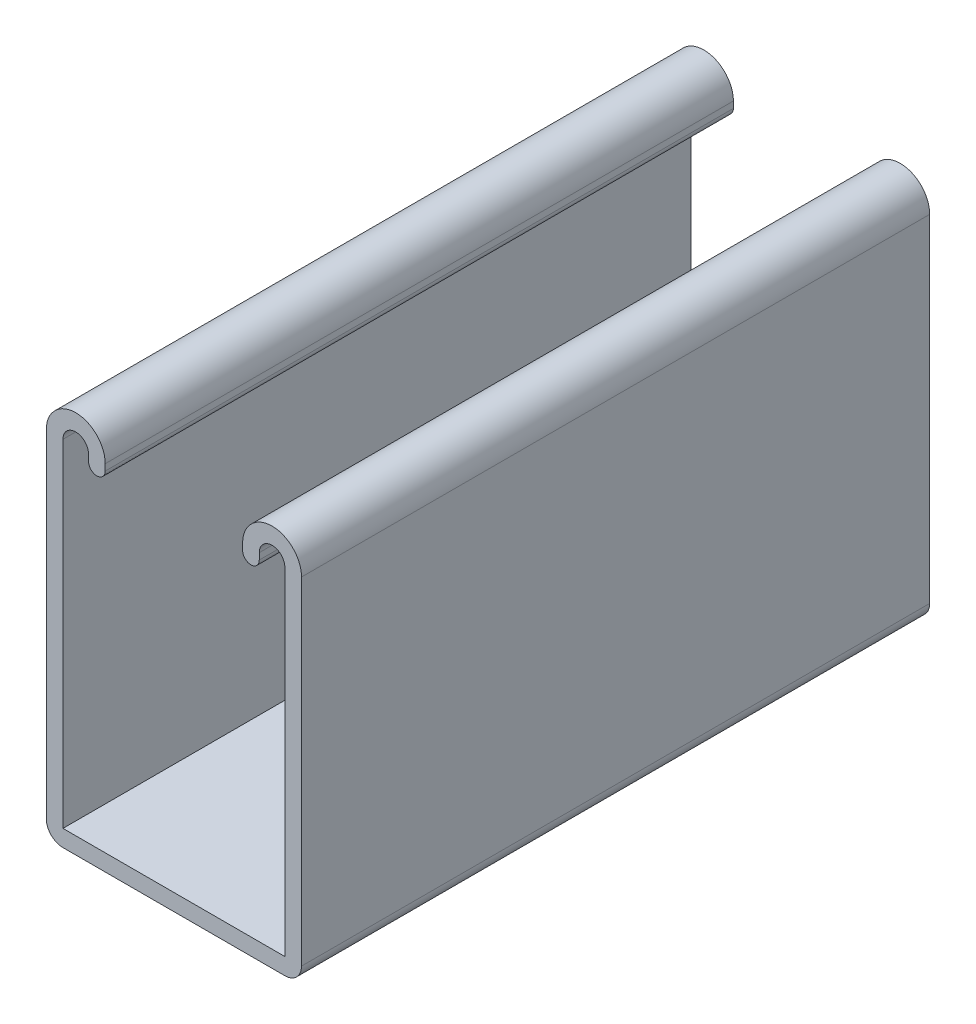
ISO-10303-21;
HEADER;
FILE_DESCRIPTION(('STEP AP214'),'2;1');
FILE_NAME('part.step','',(''),(''),'','','');
FILE_SCHEMA(('AUTOMOTIVE_DESIGN { 1 0 10303 214 1 1 1 1 }'));
ENDSEC;
DATA;
#1=APPLICATION_CONTEXT('core data for automotive mechanical design processes');
#2=APPLICATION_PROTOCOL_DEFINITION('international standard','automotive_design',2000,#1);
#3=PRODUCT_CONTEXT('',#1,'mechanical');
#4=PRODUCT('Part','Part','',(#3));
#5=PRODUCT_RELATED_PRODUCT_CATEGORY('part','',(#4));
#6=PRODUCT_DEFINITION_FORMATION('','',#4);
#7=PRODUCT_DEFINITION_CONTEXT('part definition',#1,'design');
#8=PRODUCT_DEFINITION('design','',#6,#7);
#9=PRODUCT_DEFINITION_SHAPE('','',#8);
#10=(LENGTH_UNIT() NAMED_UNIT(*) SI_UNIT(.MILLI.,.METRE.));
#11=(NAMED_UNIT(*) PLANE_ANGLE_UNIT() SI_UNIT($,.RADIAN.));
#12=(NAMED_UNIT(*) SI_UNIT($,.STERADIAN.) SOLID_ANGLE_UNIT());
#13=UNCERTAINTY_MEASURE_WITH_UNIT(LENGTH_MEASURE(1.E-05),#10,'distance_accuracy_value','');
#14=(GEOMETRIC_REPRESENTATION_CONTEXT(3) GLOBAL_UNCERTAINTY_ASSIGNED_CONTEXT((#13)) GLOBAL_UNIT_ASSIGNED_CONTEXT((#10,
#11,#12)) REPRESENTATION_CONTEXT('',''));
#15=CARTESIAN_POINT('',(0.,0.,0.));
#16=DIRECTION('',(0.,0.,1.));
#17=DIRECTION('',(1.,0.,0.));
#18=AXIS2_PLACEMENT_3D('',#15,#16,#17);
#19=CARTESIAN_POINT('',(-15.875,29.1719,101.6));
#20=DIRECTION('',(0.,0.,-1.));
#21=DIRECTION('',(-1.,0.,0.));
#22=AXIS2_PLACEMENT_3D('',#19,#20,#21);
#23=CYLINDRICAL_SURFACE('',#22,4.7625);
#24=CARTESIAN_POINT('',(-15.875,29.1719,0.));
#25=DIRECTION('',(0.,0.,1.));
#26=DIRECTION('',(-1.,0.,0.));
#27=AXIS2_PLACEMENT_3D('',#24,#25,#26);
#28=CIRCLE('',#27,4.7625);
#29=CARTESIAN_POINT('',(-11.1125,29.1719,0.));
#30=VERTEX_POINT('',#29);
#31=CARTESIAN_POINT('',(-20.6375,29.1719,0.));
#32=VERTEX_POINT('',#31);
#33=EDGE_CURVE('E196',#30,#32,#28,.T.);
#34=ORIENTED_EDGE('',*,*,#33,.T.);
#35=DIRECTION('',(0.,0.,-1.));
#36=VECTOR('',#35,1.);
#37=CARTESIAN_POINT('',(-20.6375,29.1719,101.6));
#38=LINE('',#37,#36);
#39=CARTESIAN_POINT('',(-20.6375,29.1719,101.6));
#40=VERTEX_POINT('',#39);
#41=EDGE_CURVE('E11',#40,#32,#38,.T.);
#42=ORIENTED_EDGE('',*,*,#41,.F.);
#43=CARTESIAN_POINT('',(-15.875,29.1719,101.6));
#44=DIRECTION('',(0.,0.,1.));
#45=DIRECTION('',(-1.,0.,0.));
#46=AXIS2_PLACEMENT_3D('',#43,#44,#45);
#47=CIRCLE('',#46,4.7625);
#48=CARTESIAN_POINT('',(-11.1125,29.1719,101.6));
#49=VERTEX_POINT('',#48);
#50=EDGE_CURVE('E230',#49,#40,#47,.T.);
#51=ORIENTED_EDGE('',*,*,#50,.F.);
#52=DIRECTION('',(0.,0.,-1.));
#53=VECTOR('',#52,1.);
#54=CARTESIAN_POINT('',(-11.1125,29.1719,101.6));
#55=LINE('',#54,#53);
#56=EDGE_CURVE('E192',#49,#30,#55,.T.);
#57=ORIENTED_EDGE('',*,*,#56,.T.);
#58=EDGE_LOOP('',(#34,#42,#51,#57));
#59=FACE_BOUND('',#58,.T.);
#60=ADVANCED_FACE('F39',(#59),#23,.T.);
#61=CARTESIAN_POINT('',(-20.6375,29.1719,101.6));
#62=DIRECTION('',(1.,0.,0.));
#63=DIRECTION('',(0.,1.,0.));
#64=AXIS2_PLACEMENT_3D('',#61,#62,#63);
#65=PLANE('',#64);
#66=DIRECTION('',(0.,-1.,0.));
#67=VECTOR('',#66,1.);
#68=CARTESIAN_POINT('',(-20.6375,29.1719,0.));
#69=LINE('',#68,#67);
#70=CARTESIAN_POINT('',(-20.6375,-25.3238,0.));
#71=VERTEX_POINT('',#70);
#72=EDGE_CURVE('E199',#32,#71,#69,.T.);
#73=ORIENTED_EDGE('',*,*,#72,.T.);
#74=DIRECTION('',(0.,0.,-1.));
#75=VECTOR('',#74,1.);
#76=CARTESIAN_POINT('',(-20.6375,-25.3238,101.6));
#77=LINE('',#76,#75);
#78=CARTESIAN_POINT('',(-20.6375,-25.3238,101.6));
#79=VERTEX_POINT('',#78);
#80=EDGE_CURVE('E48',#79,#71,#77,.T.);
#81=ORIENTED_EDGE('',*,*,#80,.F.);
#82=DIRECTION('',(0.,-1.,0.));
#83=VECTOR('',#82,1.);
#84=CARTESIAN_POINT('',(-20.6375,29.1719,101.6));
#85=LINE('',#84,#83);
#86=EDGE_CURVE('E129',#40,#79,#85,.T.);
#87=ORIENTED_EDGE('',*,*,#86,.F.);
#88=ORIENTED_EDGE('',*,*,#41,.T.);
#89=EDGE_LOOP('',(#73,#81,#87,#88));
#90=FACE_BOUND('',#89,.T.);
#91=ADVANCED_FACE('F339',(#90),#65,.F.);
#92=CARTESIAN_POINT('',(-17.9451,-25.3238,101.6));
#93=DIRECTION('',(0.,0.,-1.));
#94=DIRECTION('',(-1.,0.,0.));
#95=AXIS2_PLACEMENT_3D('',#92,#93,#94);
#96=CYLINDRICAL_SURFACE('',#95,2.6924);
#97=CARTESIAN_POINT('',(-17.9451,-25.3238,0.));
#98=DIRECTION('',(0.,0.,1.));
#99=DIRECTION('',(-1.,0.,0.));
#100=AXIS2_PLACEMENT_3D('',#97,#98,#99);
#101=CIRCLE('',#100,2.6924);
#102=CARTESIAN_POINT('',(-17.9451,-28.0162,0.));
#103=VERTEX_POINT('',#102);
#104=EDGE_CURVE('E201',#71,#103,#101,.T.);
#105=ORIENTED_EDGE('',*,*,#104,.T.);
#106=DIRECTION('',(0.,0.,-1.));
#107=VECTOR('',#106,1.);
#108=CARTESIAN_POINT('',(-17.9451,-28.0162,101.6));
#109=LINE('',#108,#107);
#110=CARTESIAN_POINT('',(-17.9451,-28.0162,101.6));
#111=VERTEX_POINT('',#110);
#112=EDGE_CURVE('E267',#111,#103,#109,.T.);
#113=ORIENTED_EDGE('',*,*,#112,.F.);
#114=CARTESIAN_POINT('',(-17.9451,-25.3238,101.6));
#115=DIRECTION('',(0.,0.,1.));
#116=DIRECTION('',(-1.,0.,0.));
#117=AXIS2_PLACEMENT_3D('',#114,#115,#116);
#118=CIRCLE('',#117,2.6924);
#119=EDGE_CURVE('E276',#79,#111,#118,.T.);
#120=ORIENTED_EDGE('',*,*,#119,.F.);
#121=ORIENTED_EDGE('',*,*,#80,.T.);
#122=EDGE_LOOP('',(#105,#113,#120,#121));
#123=FACE_BOUND('',#122,.T.);
#124=ADVANCED_FACE('F274',(#123),#96,.T.);
#125=CARTESIAN_POINT('',(-17.9451,-28.0162,101.6));
#126=DIRECTION('',(0.,1.,0.));
#127=DIRECTION('',(-1.,0.,0.));
#128=AXIS2_PLACEMENT_3D('',#125,#126,#127);
#129=PLANE('',#128);
#130=CARTESIAN_POINT('',(0.,-28.0162,71.4375));
#131=DIRECTION('',(0.,-1.,0.));
#132=DIRECTION('',(1.,0.,0.));
#133=AXIS2_PLACEMENT_3D('',#130,#131,#132);
#134=CIRCLE('',#133,7.14375);
#135=CARTESIAN_POINT('',(7.14375,-28.0162,71.4375));
#136=VERTEX_POINT('',#135);
#137=EDGE_CURVE('E528',#136,#136,#134,.T.);
#138=ORIENTED_EDGE('',*,*,#137,.F.);
#139=EDGE_LOOP('',(#138));
#140=FACE_BOUND('',#139,.T.);
#141=CARTESIAN_POINT('',(0.,-28.0162,23.8125));
#142=DIRECTION('',(0.,-1.,0.));
#143=DIRECTION('',(1.,0.,0.));
#144=AXIS2_PLACEMENT_3D('',#141,#142,#143);
#145=CIRCLE('',#144,7.14375);
#146=CARTESIAN_POINT('',(7.14375,-28.0162,23.8125));
#147=VERTEX_POINT('',#146);
#148=EDGE_CURVE('E532',#147,#147,#145,.T.);
#149=ORIENTED_EDGE('',*,*,#148,.F.);
#150=EDGE_LOOP('',(#149));
#151=FACE_BOUND('',#150,.T.);
#152=DIRECTION('',(1.,0.,0.));
#153=VECTOR('',#152,1.);
#154=CARTESIAN_POINT('',(-17.9451,-28.0162,0.));
#155=LINE('',#154,#153);
#156=CARTESIAN_POINT('',(17.9451,-28.0162,0.));
#157=VERTEX_POINT('',#156);
#158=EDGE_CURVE('E203',#103,#157,#155,.T.);
#159=ORIENTED_EDGE('',*,*,#158,.T.);
#160=DIRECTION('',(0.,0.,-1.));
#161=VECTOR('',#160,1.);
#162=CARTESIAN_POINT('',(17.9451,-28.0162,101.6));
#163=LINE('',#162,#161);
#164=CARTESIAN_POINT('',(17.9451,-28.0162,101.6));
#165=VERTEX_POINT('',#164);
#166=EDGE_CURVE('E264',#165,#157,#163,.T.);
#167=ORIENTED_EDGE('',*,*,#166,.F.);
#168=DIRECTION('',(1.,0.,0.));
#169=VECTOR('',#168,1.);
#170=CARTESIAN_POINT('',(-17.9451,-28.0162,101.6));
#171=LINE('',#170,#169);
#172=EDGE_CURVE('E294',#111,#165,#171,.T.);
#173=ORIENTED_EDGE('',*,*,#172,.F.);
#174=ORIENTED_EDGE('',*,*,#112,.T.);
#175=EDGE_LOOP('',(#159,#167,#173,#174));
#176=FACE_BOUND('',#175,.T.);
#177=ADVANCED_FACE('F285',(#140,#151,#176),#129,.F.);
#178=CARTESIAN_POINT('',(17.9451,-25.3238,101.6));
#179=DIRECTION('',(0.,0.,-1.));
#180=DIRECTION('',(-1.,0.,0.));
#181=AXIS2_PLACEMENT_3D('',#178,#179,#180);
#182=CYLINDRICAL_SURFACE('',#181,2.6924);
#183=CARTESIAN_POINT('',(17.9451,-25.3238,0.));
#184=DIRECTION('',(0.,0.,1.));
#185=DIRECTION('',(1.,0.,0.));
#186=AXIS2_PLACEMENT_3D('',#183,#184,#185);
#187=CIRCLE('',#186,2.6924);
#188=CARTESIAN_POINT('',(20.6375,-25.3238,0.));
#189=VERTEX_POINT('',#188);
#190=EDGE_CURVE('E205',#157,#189,#187,.T.);
#191=ORIENTED_EDGE('',*,*,#190,.T.);
#192=DIRECTION('',(0.,0.,-1.));
#193=VECTOR('',#192,1.);
#194=CARTESIAN_POINT('',(20.6375,-25.3238,101.6));
#195=LINE('',#194,#193);
#196=CARTESIAN_POINT('',(20.6375,-25.3238,101.6));
#197=VERTEX_POINT('',#196);
#198=EDGE_CURVE('E261',#197,#189,#195,.T.);
#199=ORIENTED_EDGE('',*,*,#198,.F.);
#200=CARTESIAN_POINT('',(17.9451,-25.3238,101.6));
#201=DIRECTION('',(0.,0.,1.));
#202=DIRECTION('',(1.,0.,0.));
#203=AXIS2_PLACEMENT_3D('',#200,#201,#202);
#204=CIRCLE('',#203,2.6924);
#205=EDGE_CURVE('E291',#165,#197,#204,.T.);
#206=ORIENTED_EDGE('',*,*,#205,.F.);
#207=ORIENTED_EDGE('',*,*,#166,.T.);
#208=EDGE_LOOP('',(#191,#199,#206,#207));
#209=FACE_BOUND('',#208,.T.);
#210=ADVANCED_FACE('F289',(#209),#182,.T.);
#211=CARTESIAN_POINT('',(20.6375,-25.3238,101.6));
#212=DIRECTION('',(-1.,0.,0.));
#213=DIRECTION('',(0.,-1.,0.));
#214=AXIS2_PLACEMENT_3D('',#211,#212,#213);
#215=PLANE('',#214);
#216=DIRECTION('',(0.,1.,0.));
#217=VECTOR('',#216,1.);
#218=CARTESIAN_POINT('',(20.6375,-25.3238,0.));
#219=LINE('',#218,#217);
#220=CARTESIAN_POINT('',(20.6375,29.1719,0.));
#221=VERTEX_POINT('',#220);
#222=EDGE_CURVE('E207',#189,#221,#219,.T.);
#223=ORIENTED_EDGE('',*,*,#222,.T.);
#224=DIRECTION('',(0.,0.,-1.));
#225=VECTOR('',#224,1.);
#226=CARTESIAN_POINT('',(20.6375,29.1719,101.6));
#227=LINE('',#226,#225);
#228=CARTESIAN_POINT('',(20.6375,29.1719,101.6));
#229=VERTEX_POINT('',#228);
#230=EDGE_CURVE('E258',#229,#221,#227,.T.);
#231=ORIENTED_EDGE('',*,*,#230,.F.);
#232=DIRECTION('',(0.,1.,0.));
#233=VECTOR('',#232,1.);
#234=CARTESIAN_POINT('',(20.6375,-25.3238,101.6));
#235=LINE('',#234,#233);
#236=EDGE_CURVE('E293',#197,#229,#235,.T.);
#237=ORIENTED_EDGE('',*,*,#236,.F.);
#238=ORIENTED_EDGE('',*,*,#198,.T.);
#239=EDGE_LOOP('',(#223,#231,#237,#238));
#240=FACE_BOUND('',#239,.T.);
#241=ADVANCED_FACE('F353',(#240),#215,.F.);
#242=CARTESIAN_POINT('',(15.875,29.1719,101.6));
#243=DIRECTION('',(0.,0.,-1.));
#244=DIRECTION('',(-1.,0.,0.));
#245=AXIS2_PLACEMENT_3D('',#242,#243,#244);
#246=CYLINDRICAL_SURFACE('',#245,4.7625);
#247=CARTESIAN_POINT('',(15.875,29.1719,0.));
#248=DIRECTION('',(0.,0.,1.));
#249=DIRECTION('',(1.,0.,0.));
#250=AXIS2_PLACEMENT_3D('',#247,#248,#249);
#251=CIRCLE('',#250,4.7625);
#252=CARTESIAN_POINT('',(11.1125,29.1719,0.));
#253=VERTEX_POINT('',#252);
#254=EDGE_CURVE('E209',#221,#253,#251,.T.);
#255=ORIENTED_EDGE('',*,*,#254,.T.);
#256=DIRECTION('',(0.,0.,-1.));
#257=VECTOR('',#256,1.);
#258=CARTESIAN_POINT('',(11.1125,29.1719,101.6));
#259=LINE('',#258,#257);
#260=CARTESIAN_POINT('',(11.1125,29.1719,101.6));
#261=VERTEX_POINT('',#260);
#262=EDGE_CURVE('E255',#261,#253,#259,.T.);
#263=ORIENTED_EDGE('',*,*,#262,.F.);
#264=CARTESIAN_POINT('',(15.875,29.1719,101.6));
#265=DIRECTION('',(0.,0.,1.));
#266=DIRECTION('',(1.,0.,0.));
#267=AXIS2_PLACEMENT_3D('',#264,#265,#266);
#268=CIRCLE('',#267,4.7625);
#269=EDGE_CURVE('E296',#229,#261,#268,.T.);
#270=ORIENTED_EDGE('',*,*,#269,.F.);
#271=ORIENTED_EDGE('',*,*,#230,.T.);
#272=EDGE_LOOP('',(#255,#263,#270,#271));
#273=FACE_BOUND('',#272,.T.);
#274=ADVANCED_FACE('F356',(#273),#246,.T.);
#275=CARTESIAN_POINT('',(11.1125,29.1719,101.6));
#276=DIRECTION('',(1.,0.,0.));
#277=DIRECTION('',(0.,1.,0.));
#278=AXIS2_PLACEMENT_3D('',#275,#276,#277);
#279=PLANE('',#278);
#280=DIRECTION('',(0.,-1.,0.));
#281=VECTOR('',#280,1.);
#282=CARTESIAN_POINT('',(11.1125,29.1719,0.));
#283=LINE('',#282,#281);
#284=CARTESIAN_POINT('',(11.1125,28.13685,0.));
#285=VERTEX_POINT('',#284);
#286=EDGE_CURVE('E211',#253,#285,#283,.T.);
#287=ORIENTED_EDGE('',*,*,#286,.T.);
#288=DIRECTION('',(0.,0.,-1.));
#289=VECTOR('',#288,1.);
#290=CARTESIAN_POINT('',(11.1125,28.13685,101.6));
#291=LINE('',#290,#289);
#292=CARTESIAN_POINT('',(11.1125,28.13685,101.6));
#293=VERTEX_POINT('',#292);
#294=EDGE_CURVE('E252',#293,#285,#291,.T.);
#295=ORIENTED_EDGE('',*,*,#294,.F.);
#296=DIRECTION('',(0.,-1.,0.));
#297=VECTOR('',#296,1.);
#298=CARTESIAN_POINT('',(11.1125,29.1719,101.6));
#299=LINE('',#298,#297);
#300=EDGE_CURVE('E302',#261,#293,#299,.T.);
#301=ORIENTED_EDGE('',*,*,#300,.F.);
#302=ORIENTED_EDGE('',*,*,#262,.T.);
#303=EDGE_LOOP('',(#287,#295,#301,#302));
#304=FACE_BOUND('',#303,.T.);
#305=ADVANCED_FACE('F360',(#304),#279,.F.);
#306=CARTESIAN_POINT('',(12.4587,28.13685,101.6));
#307=DIRECTION('',(0.,0.,-1.));
#308=DIRECTION('',(-1.,0.,0.));
#309=AXIS2_PLACEMENT_3D('',#306,#307,#308);
#310=CYLINDRICAL_SURFACE('',#309,1.3462);
#311=CARTESIAN_POINT('',(12.4587,28.13685,0.));
#312=DIRECTION('',(0.,0.,1.));
#313=DIRECTION('',(1.,0.,0.));
#314=AXIS2_PLACEMENT_3D('',#311,#312,#313);
#315=CIRCLE('',#314,1.3462);
#316=CARTESIAN_POINT('',(13.8049,28.13685,0.));
#317=VERTEX_POINT('',#316);
#318=EDGE_CURVE('E213',#285,#317,#315,.T.);
#319=ORIENTED_EDGE('',*,*,#318,.T.);
#320=DIRECTION('',(0.,0.,-1.));
#321=VECTOR('',#320,1.);
#322=CARTESIAN_POINT('',(13.8049,28.13685,101.6));
#323=LINE('',#322,#321);
#324=CARTESIAN_POINT('',(13.8049,28.13685,101.6));
#325=VERTEX_POINT('',#324);
#326=EDGE_CURVE('E249',#325,#317,#323,.T.);
#327=ORIENTED_EDGE('',*,*,#326,.F.);
#328=CARTESIAN_POINT('',(12.4587,28.13685,101.6));
#329=DIRECTION('',(0.,0.,1.));
#330=DIRECTION('',(1.,0.,0.));
#331=AXIS2_PLACEMENT_3D('',#328,#329,#330);
#332=CIRCLE('',#331,1.3462);
#333=EDGE_CURVE('E304',#293,#325,#332,.T.);
#334=ORIENTED_EDGE('',*,*,#333,.F.);
#335=ORIENTED_EDGE('',*,*,#294,.T.);
#336=EDGE_LOOP('',(#319,#327,#334,#335));
#337=FACE_BOUND('',#336,.T.);
#338=ADVANCED_FACE('F364',(#337),#310,.T.);
#339=CARTESIAN_POINT('',(13.8049,29.1719,101.6));
#340=DIRECTION('',(-1.,0.,0.));
#341=DIRECTION('',(0.,0.,1.));
#342=AXIS2_PLACEMENT_3D('',#339,#340,#341);
#343=PLANE('',#342);
#344=DIRECTION('',(0.,1.,0.));
#345=VECTOR('',#344,1.);
#346=CARTESIAN_POINT('',(13.8049,29.1719,0.));
#347=LINE('',#346,#345);
#348=CARTESIAN_POINT('',(13.8049,29.1719,0.));
#349=VERTEX_POINT('',#348);
#350=EDGE_CURVE('E215',#317,#349,#347,.T.);
#351=ORIENTED_EDGE('',*,*,#350,.T.);
#352=DIRECTION('',(0.,0.,-1.));
#353=VECTOR('',#352,1.);
#354=CARTESIAN_POINT('',(13.8049,29.1719,101.6));
#355=LINE('',#354,#353);
#356=CARTESIAN_POINT('',(13.8049,29.1719,101.6));
#357=VERTEX_POINT('',#356);
#358=EDGE_CURVE('E246',#357,#349,#355,.T.);
#359=ORIENTED_EDGE('',*,*,#358,.F.);
#360=DIRECTION('',(0.,1.,0.));
#361=VECTOR('',#360,1.);
#362=CARTESIAN_POINT('',(13.8049,29.1719,101.6));
#363=LINE('',#362,#361);
#364=EDGE_CURVE('E306',#325,#357,#363,.T.);
#365=ORIENTED_EDGE('',*,*,#364,.F.);
#366=ORIENTED_EDGE('',*,*,#326,.T.);
#367=EDGE_LOOP('',(#351,#359,#365,#366));
#368=FACE_BOUND('',#367,.T.);
#369=ADVANCED_FACE('F368',(#368),#343,.F.);
#370=CARTESIAN_POINT('',(15.875,29.1719,101.6));
#371=DIRECTION('',(0.,0.,-1.));
#372=DIRECTION('',(-1.,0.,0.));
#373=AXIS2_PLACEMENT_3D('',#370,#371,#372);
#374=CYLINDRICAL_SURFACE('',#373,2.0701);
#375=CARTESIAN_POINT('',(15.875,29.1719,0.));
#376=DIRECTION('',(0.,0.,-1.));
#377=DIRECTION('',(1.,0.,0.));
#378=AXIS2_PLACEMENT_3D('',#375,#376,#377);
#379=CIRCLE('',#378,2.0701);
#380=CARTESIAN_POINT('',(17.9451,29.1719,0.));
#381=VERTEX_POINT('',#380);
#382=EDGE_CURVE('E217',#349,#381,#379,.T.);
#383=ORIENTED_EDGE('',*,*,#382,.T.);
#384=DIRECTION('',(0.,0.,-1.));
#385=VECTOR('',#384,1.);
#386=CARTESIAN_POINT('',(17.9451,29.1719,101.6));
#387=LINE('',#386,#385);
#388=CARTESIAN_POINT('',(17.9451,29.1719,101.6));
#389=VERTEX_POINT('',#388);
#390=EDGE_CURVE('E243',#389,#381,#387,.T.);
#391=ORIENTED_EDGE('',*,*,#390,.F.);
#392=CARTESIAN_POINT('',(15.875,29.1719,101.6));
#393=DIRECTION('',(0.,0.,-1.));
#394=DIRECTION('',(1.,0.,0.));
#395=AXIS2_PLACEMENT_3D('',#392,#393,#394);
#396=CIRCLE('',#395,2.0701);
#397=EDGE_CURVE('E308',#357,#389,#396,.T.);
#398=ORIENTED_EDGE('',*,*,#397,.F.);
#399=ORIENTED_EDGE('',*,*,#358,.T.);
#400=EDGE_LOOP('',(#383,#391,#398,#399));
#401=FACE_BOUND('',#400,.T.);
#402=ADVANCED_FACE('F372',(#401),#374,.F.);
#403=CARTESIAN_POINT('',(17.9451,-25.3238,101.6));
#404=DIRECTION('',(1.,0.,0.));
#405=DIRECTION('',(0.,0.,-1.));
#406=AXIS2_PLACEMENT_3D('',#403,#404,#405);
#407=PLANE('',#406);
#408=DIRECTION('',(0.,-1.,0.));
#409=VECTOR('',#408,1.);
#410=CARTESIAN_POINT('',(17.9451,-25.3238,0.));
#411=LINE('',#410,#409);
#412=CARTESIAN_POINT('',(17.9451,-25.3238,0.));
#413=VERTEX_POINT('',#412);
#414=EDGE_CURVE('E219',#381,#413,#411,.T.);
#415=ORIENTED_EDGE('',*,*,#414,.T.);
#416=DIRECTION('',(0.,0.,-1.));
#417=VECTOR('',#416,1.);
#418=CARTESIAN_POINT('',(17.9451,-25.3238,101.6));
#419=LINE('',#418,#417);
#420=CARTESIAN_POINT('',(17.9451,-25.3238,101.6));
#421=VERTEX_POINT('',#420);
#422=EDGE_CURVE('E240',#421,#413,#419,.T.);
#423=ORIENTED_EDGE('',*,*,#422,.F.);
#424=DIRECTION('',(0.,-1.,0.));
#425=VECTOR('',#424,1.);
#426=CARTESIAN_POINT('',(17.9451,-25.3238,101.6));
#427=LINE('',#426,#425);
#428=EDGE_CURVE('E310',#389,#421,#427,.T.);
#429=ORIENTED_EDGE('',*,*,#428,.F.);
#430=ORIENTED_EDGE('',*,*,#390,.T.);
#431=EDGE_LOOP('',(#415,#423,#429,#430));
#432=FACE_BOUND('',#431,.T.);
#433=ADVANCED_FACE('F376',(#432),#407,.F.);
#434=CARTESIAN_POINT('',(-17.9451,-25.3238,101.6));
#435=DIRECTION('',(0.,-1.,0.));
#436=DIRECTION('',(0.,0.,-1.));
#437=AXIS2_PLACEMENT_3D('',#434,#435,#436);
#438=PLANE('',#437);
#439=CARTESIAN_POINT('',(0.,-25.3238,71.4375));
#440=DIRECTION('',(0.,-1.,0.));
#441=DIRECTION('',(0.,0.,-1.));
#442=AXIS2_PLACEMENT_3D('',#439,#440,#441);
#443=CIRCLE('',#442,7.14375);
#444=CARTESIAN_POINT('',(7.14375,-25.3238,71.4375));
#445=VERTEX_POINT('',#444);
#446=EDGE_CURVE('E531',#445,#445,#443,.T.);
#447=ORIENTED_EDGE('',*,*,#446,.T.);
#448=EDGE_LOOP('',(#447));
#449=FACE_BOUND('',#448,.T.);
#450=CARTESIAN_POINT('',(0.,-25.3238,23.8125));
#451=DIRECTION('',(0.,-1.,0.));
#452=DIRECTION('',(0.,0.,-1.));
#453=AXIS2_PLACEMENT_3D('',#450,#451,#452);
#454=CIRCLE('',#453,7.14375);
#455=CARTESIAN_POINT('',(7.14375,-25.3238,23.8125));
#456=VERTEX_POINT('',#455);
#457=EDGE_CURVE('E42',#456,#456,#454,.T.);
#458=ORIENTED_EDGE('',*,*,#457,.T.);
#459=EDGE_LOOP('',(#458));
#460=FACE_BOUND('',#459,.T.);
#461=DIRECTION('',(-1.,0.,0.));
#462=VECTOR('',#461,1.);
#463=CARTESIAN_POINT('',(-17.9451,-25.3238,0.));
#464=LINE('',#463,#462);
#465=CARTESIAN_POINT('',(-17.9451,-25.3238,0.));
#466=VERTEX_POINT('',#465);
#467=EDGE_CURVE('E221',#413,#466,#464,.T.);
#468=ORIENTED_EDGE('',*,*,#467,.T.);
#469=DIRECTION('',(0.,0.,-1.));
#470=VECTOR('',#469,1.);
#471=CARTESIAN_POINT('',(-17.9451,-25.3238,101.6));
#472=LINE('',#471,#470);
#473=CARTESIAN_POINT('',(-17.9451,-25.3238,101.6));
#474=VERTEX_POINT('',#473);
#475=EDGE_CURVE('E237',#474,#466,#472,.T.);
#476=ORIENTED_EDGE('',*,*,#475,.F.);
#477=DIRECTION('',(-1.,0.,0.));
#478=VECTOR('',#477,1.);
#479=CARTESIAN_POINT('',(-17.9451,-25.3238,101.6));
#480=LINE('',#479,#478);
#481=EDGE_CURVE('E312',#421,#474,#480,.T.);
#482=ORIENTED_EDGE('',*,*,#481,.F.);
#483=ORIENTED_EDGE('',*,*,#422,.T.);
#484=EDGE_LOOP('',(#468,#476,#482,#483));
#485=FACE_BOUND('',#484,.T.);
#486=ADVANCED_FACE('F380',(#449,#460,#485),#438,.F.);
#487=CARTESIAN_POINT('',(-17.9451,29.1719,101.6));
#488=DIRECTION('',(-1.,0.,0.));
#489=DIRECTION('',(0.,-1.,0.));
#490=AXIS2_PLACEMENT_3D('',#487,#488,#489);
#491=PLANE('',#490);
#492=DIRECTION('',(0.,1.,0.));
#493=VECTOR('',#492,1.);
#494=CARTESIAN_POINT('',(-17.9451,29.1719,0.));
#495=LINE('',#494,#493);
#496=CARTESIAN_POINT('',(-17.9451,29.1719,0.));
#497=VERTEX_POINT('',#496);
#498=EDGE_CURVE('E223',#466,#497,#495,.T.);
#499=ORIENTED_EDGE('',*,*,#498,.T.);
#500=DIRECTION('',(0.,0.,-1.));
#501=VECTOR('',#500,1.);
#502=CARTESIAN_POINT('',(-17.9451,29.1719,101.6));
#503=LINE('',#502,#501);
#504=CARTESIAN_POINT('',(-17.9451,29.1719,101.6));
#505=VERTEX_POINT('',#504);
#506=EDGE_CURVE('E234',#505,#497,#503,.T.);
#507=ORIENTED_EDGE('',*,*,#506,.F.);
#508=DIRECTION('',(0.,1.,0.));
#509=VECTOR('',#508,1.);
#510=CARTESIAN_POINT('',(-17.9451,29.1719,101.6));
#511=LINE('',#510,#509);
#512=EDGE_CURVE('E314',#474,#505,#511,.T.);
#513=ORIENTED_EDGE('',*,*,#512,.F.);
#514=ORIENTED_EDGE('',*,*,#475,.T.);
#515=EDGE_LOOP('',(#499,#507,#513,#514));
#516=FACE_BOUND('',#515,.T.);
#517=ADVANCED_FACE('F320',(#516),#491,.F.);
#518=CARTESIAN_POINT('',(-15.875,29.1719,101.6));
#519=DIRECTION('',(0.,0.,-1.));
#520=DIRECTION('',(-1.,0.,0.));
#521=AXIS2_PLACEMENT_3D('',#518,#519,#520);
#522=CYLINDRICAL_SURFACE('',#521,2.0701);
#523=CARTESIAN_POINT('',(-15.875,29.1719,0.));
#524=DIRECTION('',(0.,0.,-1.));
#525=DIRECTION('',(-1.,0.,0.));
#526=AXIS2_PLACEMENT_3D('',#523,#524,#525);
#527=CIRCLE('',#526,2.0701);
#528=CARTESIAN_POINT('',(-13.8049,29.1719,0.));
#529=VERTEX_POINT('',#528);
#530=EDGE_CURVE('E225',#497,#529,#527,.T.);
#531=ORIENTED_EDGE('',*,*,#530,.T.);
#532=DIRECTION('',(0.,0.,-1.));
#533=VECTOR('',#532,1.);
#534=CARTESIAN_POINT('',(-13.8049,29.1719,101.6));
#535=LINE('',#534,#533);
#536=CARTESIAN_POINT('',(-13.8049,29.1719,101.6));
#537=VERTEX_POINT('',#536);
#538=EDGE_CURVE('E187',#537,#529,#535,.T.);
#539=ORIENTED_EDGE('',*,*,#538,.F.);
#540=CARTESIAN_POINT('',(-15.875,29.1719,101.6));
#541=DIRECTION('',(0.,0.,-1.));
#542=DIRECTION('',(-1.,0.,0.));
#543=AXIS2_PLACEMENT_3D('',#540,#541,#542);
#544=CIRCLE('',#543,2.0701);
#545=EDGE_CURVE('E178',#505,#537,#544,.T.);
#546=ORIENTED_EDGE('',*,*,#545,.F.);
#547=ORIENTED_EDGE('',*,*,#506,.T.);
#548=EDGE_LOOP('',(#531,#539,#546,#547));
#549=FACE_BOUND('',#548,.T.);
#550=ADVANCED_FACE('F324',(#549),#522,.F.);
#551=CARTESIAN_POINT('',(-13.8049,29.1719,101.6));
#552=DIRECTION('',(1.,0.,0.));
#553=DIRECTION('',(0.,0.,-1.));
#554=AXIS2_PLACEMENT_3D('',#551,#552,#553);
#555=PLANE('',#554);
#556=DIRECTION('',(0.,-1.,0.));
#557=VECTOR('',#556,1.);
#558=CARTESIAN_POINT('',(-13.8049,29.1719,0.));
#559=LINE('',#558,#557);
#560=CARTESIAN_POINT('',(-13.8049,28.13685,0.));
#561=VERTEX_POINT('',#560);
#562=EDGE_CURVE('E186',#529,#561,#559,.T.);
#563=ORIENTED_EDGE('',*,*,#562,.T.);
#564=DIRECTION('',(0.,0.,-1.));
#565=VECTOR('',#564,1.);
#566=CARTESIAN_POINT('',(-13.8049,28.13685,101.6));
#567=LINE('',#566,#565);
#568=CARTESIAN_POINT('',(-13.8049,28.13685,101.6));
#569=VERTEX_POINT('',#568);
#570=EDGE_CURVE('E183',#569,#561,#567,.T.);
#571=ORIENTED_EDGE('',*,*,#570,.F.);
#572=DIRECTION('',(0.,-1.,0.));
#573=VECTOR('',#572,1.);
#574=CARTESIAN_POINT('',(-13.8049,29.1719,101.6));
#575=LINE('',#574,#573);
#576=EDGE_CURVE('E172',#537,#569,#575,.T.);
#577=ORIENTED_EDGE('',*,*,#576,.F.);
#578=ORIENTED_EDGE('',*,*,#538,.T.);
#579=EDGE_LOOP('',(#563,#571,#577,#578));
#580=FACE_BOUND('',#579,.T.);
#581=ADVANCED_FACE('F184',(#580),#555,.F.);
#582=CARTESIAN_POINT('',(-12.4587,28.13685,101.6));
#583=DIRECTION('',(0.,0.,-1.));
#584=DIRECTION('',(-1.,0.,0.));
#585=AXIS2_PLACEMENT_3D('',#582,#583,#584);
#586=CYLINDRICAL_SURFACE('',#585,1.3462);
#587=CARTESIAN_POINT('',(-12.4587,28.13685,0.));
#588=DIRECTION('',(0.,0.,1.));
#589=DIRECTION('',(-1.,0.,0.));
#590=AXIS2_PLACEMENT_3D('',#587,#588,#589);
#591=CIRCLE('',#590,1.3462);
#592=CARTESIAN_POINT('',(-11.1125,28.13685,0.));
#593=VERTEX_POINT('',#592);
#594=EDGE_CURVE('E115',#561,#593,#591,.T.);
#595=ORIENTED_EDGE('',*,*,#594,.T.);
#596=DIRECTION('',(0.,0.,-1.));
#597=VECTOR('',#596,1.);
#598=CARTESIAN_POINT('',(-11.1125,28.13685,101.6));
#599=LINE('',#598,#597);
#600=CARTESIAN_POINT('',(-11.1125,28.13685,101.6));
#601=VERTEX_POINT('',#600);
#602=EDGE_CURVE('E188',#601,#593,#599,.T.);
#603=ORIENTED_EDGE('',*,*,#602,.F.);
#604=CARTESIAN_POINT('',(-12.4587,28.13685,101.6));
#605=DIRECTION('',(0.,0.,1.));
#606=DIRECTION('',(-1.,0.,0.));
#607=AXIS2_PLACEMENT_3D('',#604,#605,#606);
#608=CIRCLE('',#607,1.3462);
#609=EDGE_CURVE('E176',#569,#601,#608,.T.);
#610=ORIENTED_EDGE('',*,*,#609,.F.);
#611=ORIENTED_EDGE('',*,*,#570,.T.);
#612=EDGE_LOOP('',(#595,#603,#610,#611));
#613=FACE_BOUND('',#612,.T.);
#614=ADVANCED_FACE('F190',(#613),#586,.T.);
#615=CARTESIAN_POINT('',(-11.1125,29.1719,101.6));
#616=DIRECTION('',(-1.,0.,0.));
#617=DIRECTION('',(0.,-1.,0.));
#618=AXIS2_PLACEMENT_3D('',#615,#616,#617);
#619=PLANE('',#618);
#620=DIRECTION('',(0.,1.,0.));
#621=VECTOR('',#620,1.);
#622=CARTESIAN_POINT('',(-11.1125,29.1719,0.));
#623=LINE('',#622,#621);
#624=EDGE_CURVE('E121',#593,#30,#623,.T.);
#625=ORIENTED_EDGE('',*,*,#624,.T.);
#626=ORIENTED_EDGE('',*,*,#56,.F.);
#627=DIRECTION('',(0.,1.,0.));
#628=VECTOR('',#627,1.);
#629=CARTESIAN_POINT('',(-11.1125,29.1719,101.6));
#630=LINE('',#629,#628);
#631=EDGE_CURVE('E56',#601,#49,#630,.T.);
#632=ORIENTED_EDGE('',*,*,#631,.F.);
#633=ORIENTED_EDGE('',*,*,#602,.T.);
#634=EDGE_LOOP('',(#625,#626,#632,#633));
#635=FACE_BOUND('',#634,.T.);
#636=ADVANCED_FACE('F328',(#635),#619,.F.);
#637=CARTESIAN_POINT('',(-15.875,29.1719,101.6));
#638=DIRECTION('',(0.,0.,-1.));
#639=DIRECTION('',(-1.,0.,0.));
#640=AXIS2_PLACEMENT_3D('',#637,#638,#639);
#641=PLANE('',#640);
#642=ORIENTED_EDGE('',*,*,#50,.T.);
#643=ORIENTED_EDGE('',*,*,#86,.T.);
#644=ORIENTED_EDGE('',*,*,#119,.T.);
#645=ORIENTED_EDGE('',*,*,#172,.T.);
#646=ORIENTED_EDGE('',*,*,#205,.T.);
#647=ORIENTED_EDGE('',*,*,#236,.T.);
#648=ORIENTED_EDGE('',*,*,#269,.T.);
#649=ORIENTED_EDGE('',*,*,#300,.T.);
#650=ORIENTED_EDGE('',*,*,#333,.T.);
#651=ORIENTED_EDGE('',*,*,#364,.T.);
#652=ORIENTED_EDGE('',*,*,#397,.T.);
#653=ORIENTED_EDGE('',*,*,#428,.T.);
#654=ORIENTED_EDGE('',*,*,#481,.T.);
#655=ORIENTED_EDGE('',*,*,#512,.T.);
#656=ORIENTED_EDGE('',*,*,#545,.T.);
#657=ORIENTED_EDGE('',*,*,#576,.T.);
#658=ORIENTED_EDGE('',*,*,#609,.T.);
#659=ORIENTED_EDGE('',*,*,#631,.T.);
#660=EDGE_LOOP('',(#642,#643,#644,#645,#646,#647,#648,#649,#650,#651,#652,#653,#654,#655,#656,
#657,#658,#659));
#661=FACE_BOUND('',#660,.T.);
#662=ADVANCED_FACE('F174',(#661),#641,.F.);
#663=CARTESIAN_POINT('',(-15.875,29.1719,0.));
#664=DIRECTION('',(0.,0.,-1.));
#665=DIRECTION('',(-1.,0.,0.));
#666=AXIS2_PLACEMENT_3D('',#663,#664,#665);
#667=PLANE('',#666);
#668=ORIENTED_EDGE('',*,*,#33,.F.);
#669=ORIENTED_EDGE('',*,*,#624,.F.);
#670=ORIENTED_EDGE('',*,*,#594,.F.);
#671=ORIENTED_EDGE('',*,*,#562,.F.);
#672=ORIENTED_EDGE('',*,*,#530,.F.);
#673=ORIENTED_EDGE('',*,*,#498,.F.);
#674=ORIENTED_EDGE('',*,*,#467,.F.);
#675=ORIENTED_EDGE('',*,*,#414,.F.);
#676=ORIENTED_EDGE('',*,*,#382,.F.);
#677=ORIENTED_EDGE('',*,*,#350,.F.);
#678=ORIENTED_EDGE('',*,*,#318,.F.);
#679=ORIENTED_EDGE('',*,*,#286,.F.);
#680=ORIENTED_EDGE('',*,*,#254,.F.);
#681=ORIENTED_EDGE('',*,*,#222,.F.);
#682=ORIENTED_EDGE('',*,*,#190,.F.);
#683=ORIENTED_EDGE('',*,*,#158,.F.);
#684=ORIENTED_EDGE('',*,*,#104,.F.);
#685=ORIENTED_EDGE('',*,*,#72,.F.);
#686=EDGE_LOOP('',(#668,#669,#670,#671,#672,#673,#674,#675,#676,#677,#678,#679,#680,#681,#682,
#683,#684,#685));
#687=FACE_BOUND('',#686,.T.);
#688=ADVANCED_FACE('F280',(#687),#667,.T.);
#689=CARTESIAN_POINT('',(0.,33.9344,23.8125));
#690=DIRECTION('',(0.,-1.,0.));
#691=DIRECTION('',(1.,0.,0.));
#692=AXIS2_PLACEMENT_3D('',#689,#690,#691);
#693=CYLINDRICAL_SURFACE('',#692,7.14375);
#694=CARTESIAN_POINT('',(7.14375,-28.0162,23.8125));
#695=CARTESIAN_POINT('',(7.14375,-27.9881541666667,23.8125));
#696=CARTESIAN_POINT('',(7.14375,-27.9601083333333,23.8125));
#697=CARTESIAN_POINT('',(7.14375,-27.9040166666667,23.8125));
#698=CARTESIAN_POINT('',(7.14375,-27.8759708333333,23.8125));
#699=CARTESIAN_POINT('',(7.14375,-27.8198791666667,23.8125));
#700=CARTESIAN_POINT('',(7.14375,-27.7918333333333,23.8125));
#701=CARTESIAN_POINT('',(7.14375,-27.7357416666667,23.8125));
#702=CARTESIAN_POINT('',(7.14375,-27.7076958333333,23.8125));
#703=CARTESIAN_POINT('',(7.14375,-27.6516041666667,23.8125));
#704=CARTESIAN_POINT('',(7.14375,-27.6235583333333,23.8125));
#705=CARTESIAN_POINT('',(7.14375,-27.5674666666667,23.8125));
#706=CARTESIAN_POINT('',(7.14375,-27.5394208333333,23.8125));
#707=CARTESIAN_POINT('',(7.14375,-27.4833291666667,23.8125));
#708=CARTESIAN_POINT('',(7.14375,-27.4552833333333,23.8125));
#709=CARTESIAN_POINT('',(7.14375,-27.3991916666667,23.8125));
#710=CARTESIAN_POINT('',(7.14375,-27.3711458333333,23.8125));
#711=CARTESIAN_POINT('',(7.14375,-27.3150541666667,23.8125));
#712=CARTESIAN_POINT('',(7.14375,-27.2870083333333,23.8125));
#713=CARTESIAN_POINT('',(7.14375,-27.2309166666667,23.8125));
#714=CARTESIAN_POINT('',(7.14375,-27.2028708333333,23.8125));
#715=CARTESIAN_POINT('',(7.14375,-27.1467791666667,23.8125));
#716=CARTESIAN_POINT('',(7.14375,-27.1187333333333,23.8125));
#717=CARTESIAN_POINT('',(7.14375,-27.0626416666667,23.8125));
#718=CARTESIAN_POINT('',(7.14375,-27.0345958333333,23.8125));
#719=CARTESIAN_POINT('',(7.14375,-26.9785041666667,23.8125));
#720=CARTESIAN_POINT('',(7.14375,-26.9504583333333,23.8125));
#721=CARTESIAN_POINT('',(7.14375,-26.8943666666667,23.8125));
#722=CARTESIAN_POINT('',(7.14375,-26.8663208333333,23.8125));
#723=CARTESIAN_POINT('',(7.14375,-26.8102291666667,23.8125));
#724=CARTESIAN_POINT('',(7.14375,-26.7821833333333,23.8125));
#725=CARTESIAN_POINT('',(7.14375,-26.7260916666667,23.8125));
#726=CARTESIAN_POINT('',(7.14375,-26.6980458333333,23.8125));
#727=CARTESIAN_POINT('',(7.14375,-26.6419541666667,23.8125));
#728=CARTESIAN_POINT('',(7.14375,-26.6139083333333,23.8125));
#729=CARTESIAN_POINT('',(7.14375,-26.5578166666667,23.8125));
#730=CARTESIAN_POINT('',(7.14375,-26.5297708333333,23.8125));
#731=CARTESIAN_POINT('',(7.14375,-26.4736791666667,23.8125));
#732=CARTESIAN_POINT('',(7.14375,-26.4456333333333,23.8125));
#733=CARTESIAN_POINT('',(7.14375,-26.3895416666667,23.8125));
#734=CARTESIAN_POINT('',(7.14375,-26.3614958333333,23.8125));
#735=CARTESIAN_POINT('',(7.14375,-26.3054041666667,23.8125));
#736=CARTESIAN_POINT('',(7.14375,-26.2773583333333,23.8125));
#737=CARTESIAN_POINT('',(7.14375,-26.2212666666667,23.8125));
#738=CARTESIAN_POINT('',(7.14375,-26.1932208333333,23.8125));
#739=CARTESIAN_POINT('',(7.14375,-26.1371291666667,23.8125));
#740=CARTESIAN_POINT('',(7.14375,-26.1090833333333,23.8125));
#741=CARTESIAN_POINT('',(7.14375,-26.0529916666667,23.8125));
#742=CARTESIAN_POINT('',(7.14375,-26.0249458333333,23.8125));
#743=CARTESIAN_POINT('',(7.14375,-25.9688541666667,23.8125));
#744=CARTESIAN_POINT('',(7.14375,-25.9408083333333,23.8125));
#745=CARTESIAN_POINT('',(7.14375,-25.8847166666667,23.8125));
#746=CARTESIAN_POINT('',(7.14375,-25.8566708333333,23.8125));
#747=CARTESIAN_POINT('',(7.14375,-25.8005791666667,23.8125));
#748=CARTESIAN_POINT('',(7.14375,-25.7725333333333,23.8125));
#749=CARTESIAN_POINT('',(7.14375,-25.7164416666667,23.8125));
#750=CARTESIAN_POINT('',(7.14375,-25.6883958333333,23.8125));
#751=CARTESIAN_POINT('',(7.14375,-25.6323041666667,23.8125));
#752=CARTESIAN_POINT('',(7.14375,-25.6042583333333,23.8125));
#753=CARTESIAN_POINT('',(7.14375,-25.5481666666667,23.8125));
#754=CARTESIAN_POINT('',(7.14375,-25.5201208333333,23.8125));
#755=CARTESIAN_POINT('',(7.14375,-25.4640291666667,23.8125));
#756=CARTESIAN_POINT('',(7.14375,-25.4359833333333,23.8125));
#757=CARTESIAN_POINT('',(7.14375,-25.3798916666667,23.8125));
#758=CARTESIAN_POINT('',(7.14375,-25.3518458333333,23.8125));
#759=CARTESIAN_POINT('',(7.14375,-25.3238,23.8125));
#760=B_SPLINE_CURVE_WITH_KNOTS('',3,(#694,#695,#696,#697,#698,#699,#700,#701,#702,#703,#704,
#705,#706,#707,#708,#709,#710,#711,#712,#713,#714,#715,#716,#717,#718,#719,#720,#721,#722,#723,
#724,#725,#726,#727,#728,#729,#730,#731,#732,#733,#734,#735,#736,#737,#738,#739,#740,#741,#742,
#743,#744,#745,#746,#747,#748,#749,#750,#751,#752,#753,#754,#755,#756,#757,#758,#759),
.UNSPECIFIED.,.F.,.F.,(4,2,2,2,2,2,2,2,2,2,2,2,2,2,2,2,2,2,2,2,2,2,2,2,2,2,2,2,2,2,2,2,4),(0.,
0.0841374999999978,0.168275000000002,0.2524125,0.336549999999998,0.420687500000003,0.504825,
0.588962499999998,0.673099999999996,0.757237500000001,0.841374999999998,0.925512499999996,
1.00965,1.0937875,1.177925,1.2620625,1.3462,1.4303375,1.514475,1.5986125,1.68275,1.7668875,
1.851025,1.9351625,2.0193,2.1034375,2.187575,2.2717125,2.35585,2.4399875,2.524125,2.6082625,
2.6924),.UNSPECIFIED.);
#761=EDGE_CURVE('BSEAM419',#147,#456,#760,.T.);
#762=ORIENTED_EDGE('',*,*,#148,.T.);
#763=ORIENTED_EDGE('',*,*,#457,.F.);
#764=ORIENTED_EDGE('',*,*,#761,.T.);
#765=ORIENTED_EDGE('',*,*,#761,.F.);
#766=EDGE_LOOP('',(#762,#764,#763,#765));
#767=FACE_BOUND('',#766,.T.);
#768=ADVANCED_FACE('F419',(#767),#693,.F.);
#769=CARTESIAN_POINT('',(0.,33.9344,71.4375));
#770=DIRECTION('',(0.,-1.,0.));
#771=DIRECTION('',(1.,0.,0.));
#772=AXIS2_PLACEMENT_3D('',#769,#770,#771);
#773=CYLINDRICAL_SURFACE('',#772,7.14375);
#774=CARTESIAN_POINT('',(7.14375,-28.0162,71.4375));
#775=CARTESIAN_POINT('',(7.14375,-27.9881541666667,71.4375));
#776=CARTESIAN_POINT('',(7.14375,-27.9601083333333,71.4375));
#777=CARTESIAN_POINT('',(7.14375,-27.9040166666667,71.4375));
#778=CARTESIAN_POINT('',(7.14375,-27.8759708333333,71.4375));
#779=CARTESIAN_POINT('',(7.14375,-27.8198791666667,71.4375));
#780=CARTESIAN_POINT('',(7.14375,-27.7918333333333,71.4375));
#781=CARTESIAN_POINT('',(7.14375,-27.7357416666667,71.4375));
#782=CARTESIAN_POINT('',(7.14375,-27.7076958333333,71.4375));
#783=CARTESIAN_POINT('',(7.14375,-27.6516041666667,71.4375));
#784=CARTESIAN_POINT('',(7.14375,-27.6235583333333,71.4375));
#785=CARTESIAN_POINT('',(7.14375,-27.5674666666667,71.4375));
#786=CARTESIAN_POINT('',(7.14375,-27.5394208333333,71.4375));
#787=CARTESIAN_POINT('',(7.14375,-27.4833291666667,71.4375));
#788=CARTESIAN_POINT('',(7.14375,-27.4552833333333,71.4375));
#789=CARTESIAN_POINT('',(7.14375,-27.3991916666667,71.4375));
#790=CARTESIAN_POINT('',(7.14375,-27.3711458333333,71.4375));
#791=CARTESIAN_POINT('',(7.14375,-27.3150541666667,71.4375));
#792=CARTESIAN_POINT('',(7.14375,-27.2870083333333,71.4375));
#793=CARTESIAN_POINT('',(7.14375,-27.2309166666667,71.4375));
#794=CARTESIAN_POINT('',(7.14375,-27.2028708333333,71.4375));
#795=CARTESIAN_POINT('',(7.14375,-27.1467791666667,71.4375));
#796=CARTESIAN_POINT('',(7.14375,-27.1187333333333,71.4375));
#797=CARTESIAN_POINT('',(7.14375,-27.0626416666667,71.4375));
#798=CARTESIAN_POINT('',(7.14375,-27.0345958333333,71.4375));
#799=CARTESIAN_POINT('',(7.14375,-26.9785041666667,71.4375));
#800=CARTESIAN_POINT('',(7.14375,-26.9504583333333,71.4375));
#801=CARTESIAN_POINT('',(7.14375,-26.8943666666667,71.4375));
#802=CARTESIAN_POINT('',(7.14375,-26.8663208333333,71.4375));
#803=CARTESIAN_POINT('',(7.14375,-26.8102291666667,71.4375));
#804=CARTESIAN_POINT('',(7.14375,-26.7821833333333,71.4375));
#805=CARTESIAN_POINT('',(7.14375,-26.7260916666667,71.4375));
#806=CARTESIAN_POINT('',(7.14375,-26.6980458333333,71.4375));
#807=CARTESIAN_POINT('',(7.14375,-26.6419541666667,71.4375));
#808=CARTESIAN_POINT('',(7.14375,-26.6139083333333,71.4375));
#809=CARTESIAN_POINT('',(7.14375,-26.5578166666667,71.4375));
#810=CARTESIAN_POINT('',(7.14375,-26.5297708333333,71.4375));
#811=CARTESIAN_POINT('',(7.14375,-26.4736791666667,71.4375));
#812=CARTESIAN_POINT('',(7.14375,-26.4456333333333,71.4375));
#813=CARTESIAN_POINT('',(7.14375,-26.3895416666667,71.4375));
#814=CARTESIAN_POINT('',(7.14375,-26.3614958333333,71.4375));
#815=CARTESIAN_POINT('',(7.14375,-26.3054041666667,71.4375));
#816=CARTESIAN_POINT('',(7.14375,-26.2773583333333,71.4375));
#817=CARTESIAN_POINT('',(7.14375,-26.2212666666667,71.4375));
#818=CARTESIAN_POINT('',(7.14375,-26.1932208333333,71.4375));
#819=CARTESIAN_POINT('',(7.14375,-26.1371291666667,71.4375));
#820=CARTESIAN_POINT('',(7.14375,-26.1090833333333,71.4375));
#821=CARTESIAN_POINT('',(7.14375,-26.0529916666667,71.4375));
#822=CARTESIAN_POINT('',(7.14375,-26.0249458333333,71.4375));
#823=CARTESIAN_POINT('',(7.14375,-25.9688541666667,71.4375));
#824=CARTESIAN_POINT('',(7.14375,-25.9408083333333,71.4375));
#825=CARTESIAN_POINT('',(7.14375,-25.8847166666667,71.4375));
#826=CARTESIAN_POINT('',(7.14375,-25.8566708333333,71.4375));
#827=CARTESIAN_POINT('',(7.14375,-25.8005791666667,71.4375));
#828=CARTESIAN_POINT('',(7.14375,-25.7725333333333,71.4375));
#829=CARTESIAN_POINT('',(7.14375,-25.7164416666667,71.4375));
#830=CARTESIAN_POINT('',(7.14375,-25.6883958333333,71.4375));
#831=CARTESIAN_POINT('',(7.14375,-25.6323041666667,71.4375));
#832=CARTESIAN_POINT('',(7.14375,-25.6042583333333,71.4375));
#833=CARTESIAN_POINT('',(7.14375,-25.5481666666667,71.4375));
#834=CARTESIAN_POINT('',(7.14375,-25.5201208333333,71.4375));
#835=CARTESIAN_POINT('',(7.14375,-25.4640291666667,71.4375));
#836=CARTESIAN_POINT('',(7.14375,-25.4359833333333,71.4375));
#837=CARTESIAN_POINT('',(7.14375,-25.3798916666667,71.4375));
#838=CARTESIAN_POINT('',(7.14375,-25.3518458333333,71.4375));
#839=CARTESIAN_POINT('',(7.14375,-25.3238,71.4375));
#840=B_SPLINE_CURVE_WITH_KNOTS('',3,(#774,#775,#776,#777,#778,#779,#780,#781,#782,#783,#784,
#785,#786,#787,#788,#789,#790,#791,#792,#793,#794,#795,#796,#797,#798,#799,#800,#801,#802,#803,
#804,#805,#806,#807,#808,#809,#810,#811,#812,#813,#814,#815,#816,#817,#818,#819,#820,#821,#822,
#823,#824,#825,#826,#827,#828,#829,#830,#831,#832,#833,#834,#835,#836,#837,#838,#839),
.UNSPECIFIED.,.F.,.F.,(4,2,2,2,2,2,2,2,2,2,2,2,2,2,2,2,2,2,2,2,2,2,2,2,2,2,2,2,2,2,2,2,4),(0.,
0.0841374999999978,0.168275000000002,0.2524125,0.336549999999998,0.420687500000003,0.504825,
0.588962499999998,0.673099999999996,0.757237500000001,0.841374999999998,0.925512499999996,
1.00965,1.0937875,1.177925,1.2620625,1.3462,1.4303375,1.514475,1.5986125,1.68275,1.7668875,
1.851025,1.9351625,2.0193,2.1034375,2.187575,2.2717125,2.35585,2.4399875,2.524125,2.6082625,
2.6924),.UNSPECIFIED.);
#841=EDGE_CURVE('BSEAM427',#136,#445,#840,.T.);
#842=ORIENTED_EDGE('',*,*,#137,.T.);
#843=ORIENTED_EDGE('',*,*,#446,.F.);
#844=ORIENTED_EDGE('',*,*,#841,.T.);
#845=ORIENTED_EDGE('',*,*,#841,.F.);
#846=EDGE_LOOP('',(#842,#844,#843,#845));
#847=FACE_BOUND('',#846,.T.);
#848=ADVANCED_FACE('F427',(#847),#773,.F.);
#849=CLOSED_SHELL('',(#60,#91,#124,#177,#210,#241,#274,#305,#338,#369,#402,#433,#486,#517,#550,
#581,#614,#636,#662,#688,#768,#848));
#850=MANIFOLD_SOLID_BREP('B2',#849);
#851=ADVANCED_BREP_SHAPE_REPRESENTATION('',(#18,#850),#14);
#852=SHAPE_DEFINITION_REPRESENTATION(#9,#851);
ENDSEC;
END-ISO-10303-21;
